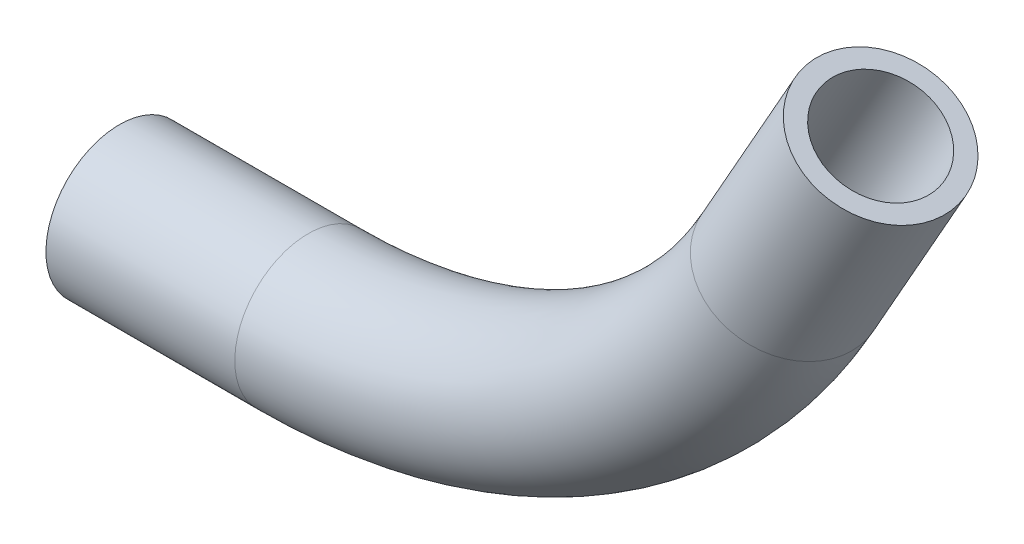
from build123d import *

# Parameters (mm, degrees)
ESQUISSE2_R   = 2
ESQUISSE2_R_2 = 1.5


with BuildPart() as part:
    # Balayage1: sweep along a path in Esquisse1
    with BuildLine(Plane.XY) as balayage1_path:
        Line((0, 0), (5.142443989, 0))
        ThreePointArc((5.142443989, 0), (12.700509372, 2.043316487), (18.199438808, 7.616580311))
        Line((18.199438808, 7.616580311), (20.730693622, 12.092904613))
    # Esquisse2 → Balayage1 (sweep)
    with BuildSketch(Plane(origin=(0, 0, 0), x_dir=(0, 0, -1), z_dir=(1, 0, 0))):
        Circle(ESQUISSE2_R)
        Circle(ESQUISSE2_R_2, mode=Mode.SUBTRACT)
    sweep(path=balayage1_path.line)


solid = part.part
